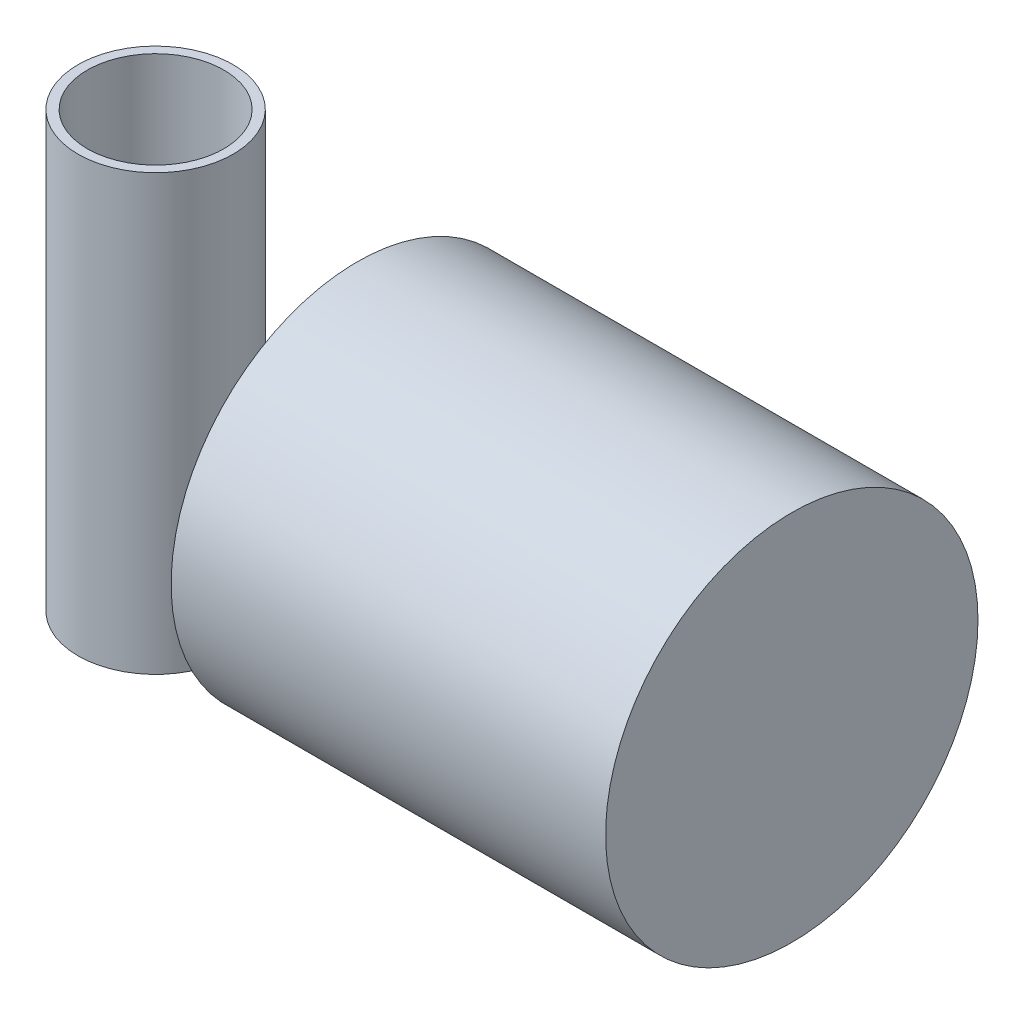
ISO-10303-21;
HEADER;
FILE_DESCRIPTION(('STEP AP214'),'2;1');
FILE_NAME('part.step','',(''),(''),'','','');
FILE_SCHEMA(('AUTOMOTIVE_DESIGN { 1 0 10303 214 1 1 1 1 }'));
ENDSEC;
DATA;
#1=APPLICATION_CONTEXT('core data for automotive mechanical design processes');
#2=APPLICATION_PROTOCOL_DEFINITION('international standard','automotive_design',2000,#1);
#3=PRODUCT_CONTEXT('',#1,'mechanical');
#4=PRODUCT('Part','Part','',(#3));
#5=PRODUCT_RELATED_PRODUCT_CATEGORY('part','',(#4));
#6=PRODUCT_DEFINITION_FORMATION('','',#4);
#7=PRODUCT_DEFINITION_CONTEXT('part definition',#1,'design');
#8=PRODUCT_DEFINITION('design','',#6,#7);
#9=PRODUCT_DEFINITION_SHAPE('','',#8);
#10=(LENGTH_UNIT() NAMED_UNIT(*) SI_UNIT(.MILLI.,.METRE.));
#11=(NAMED_UNIT(*) PLANE_ANGLE_UNIT() SI_UNIT($,.RADIAN.));
#12=(NAMED_UNIT(*) SI_UNIT($,.STERADIAN.) SOLID_ANGLE_UNIT());
#13=UNCERTAINTY_MEASURE_WITH_UNIT(LENGTH_MEASURE(1.E-05),#10,'distance_accuracy_value','');
#14=(GEOMETRIC_REPRESENTATION_CONTEXT(3) GLOBAL_UNCERTAINTY_ASSIGNED_CONTEXT((#13)) GLOBAL_UNIT_ASSIGNED_CONTEXT((#10,
#11,#12)) REPRESENTATION_CONTEXT('',''));
#15=CARTESIAN_POINT('',(0.,0.,0.));
#16=DIRECTION('',(0.,0.,1.));
#17=DIRECTION('',(1.,0.,0.));
#18=AXIS2_PLACEMENT_3D('',#15,#16,#17);
#19=CARTESIAN_POINT('',(-32.5,35.,0.));
#20=DIRECTION('',(0.,1.,0.));
#21=DIRECTION('',(0.,0.,1.));
#22=AXIS2_PLACEMENT_3D('',#19,#20,#21);
#23=CYLINDRICAL_SURFACE('',#22,12.5);
#24=CARTESIAN_POINT('',(-32.5,35.,0.));
#25=DIRECTION('',(0.,1.,0.));
#26=DIRECTION('',(0.,0.,1.));
#27=AXIS2_PLACEMENT_3D('',#24,#25,#26);
#28=CIRCLE('',#27,12.5);
#29=CARTESIAN_POINT('',(-32.5,35.,12.5));
#30=VERTEX_POINT('',#29);
#31=EDGE_CURVE('P0_E28',#30,#30,#28,.T.);
#32=ORIENTED_EDGE('',*,*,#31,.F.);
#33=EDGE_LOOP('',(#32));
#34=FACE_BOUND('',#33,.T.);
#35=CARTESIAN_POINT('',(-32.5,-35.,0.));
#36=DIRECTION('',(0.,1.,0.));
#37=DIRECTION('',(0.,0.,1.));
#38=AXIS2_PLACEMENT_3D('',#35,#36,#37);
#39=CIRCLE('',#38,12.5);
#40=CARTESIAN_POINT('',(-32.5,-35.,12.5));
#41=VERTEX_POINT('',#40);
#42=EDGE_CURVE('P0_E19',#41,#41,#39,.F.);
#43=ORIENTED_EDGE('',*,*,#42,.F.);
#44=EDGE_LOOP('',(#43));
#45=FACE_BOUND('',#44,.T.);
#46=ADVANCED_FACE('P0_F15',(#34,#45),#23,.T.);
#47=CARTESIAN_POINT('',(-46.25,-35.,13.75));
#48=DIRECTION('',(0.,-1.,0.));
#49=DIRECTION('',(0.,0.,-1.));
#50=AXIS2_PLACEMENT_3D('',#47,#48,#49);
#51=PLANE('',#50);
#52=CARTESIAN_POINT('',(-32.5,-35.,0.));
#53=DIRECTION('',(0.,1.,0.));
#54=DIRECTION('',(0.,0.,1.));
#55=AXIS2_PLACEMENT_3D('',#52,#53,#54);
#56=CIRCLE('',#55,11.);
#57=CARTESIAN_POINT('',(-32.5,-35.,11.));
#58=VERTEX_POINT('',#57);
#59=EDGE_CURVE('P0_E23',#58,#58,#56,.F.);
#60=ORIENTED_EDGE('',*,*,#59,.F.);
#61=EDGE_LOOP('',(#60));
#62=FACE_BOUND('',#61,.T.);
#63=ORIENTED_EDGE('',*,*,#42,.T.);
#64=EDGE_LOOP('',(#63));
#65=FACE_BOUND('',#64,.T.);
#66=ADVANCED_FACE('P0_F36',(#62,#65),#51,.T.);
#67=CARTESIAN_POINT('',(-46.25,35.,-13.75));
#68=DIRECTION('',(0.,1.,0.));
#69=DIRECTION('',(0.,0.,1.));
#70=AXIS2_PLACEMENT_3D('',#67,#68,#69);
#71=PLANE('',#70);
#72=CARTESIAN_POINT('',(-32.5,35.,0.));
#73=DIRECTION('',(0.,1.,0.));
#74=DIRECTION('',(0.,0.,1.));
#75=AXIS2_PLACEMENT_3D('',#72,#73,#74);
#76=CIRCLE('',#75,11.);
#77=CARTESIAN_POINT('',(-32.5,35.,11.));
#78=VERTEX_POINT('',#77);
#79=EDGE_CURVE('P0_E10',#78,#78,#76,.T.);
#80=ORIENTED_EDGE('',*,*,#79,.F.);
#81=EDGE_LOOP('',(#80));
#82=FACE_BOUND('',#81,.T.);
#83=ORIENTED_EDGE('',*,*,#31,.T.);
#84=EDGE_LOOP('',(#83));
#85=FACE_BOUND('',#84,.T.);
#86=ADVANCED_FACE('P0_F45',(#82,#85),#71,.T.);
#87=CARTESIAN_POINT('',(-32.5,-35.,0.));
#88=DIRECTION('',(0.,1.,0.));
#89=DIRECTION('',(0.,0.,1.));
#90=AXIS2_PLACEMENT_3D('',#87,#88,#89);
#91=CYLINDRICAL_SURFACE('',#90,11.);
#92=ORIENTED_EDGE('',*,*,#79,.T.);
#93=EDGE_LOOP('',(#92));
#94=FACE_BOUND('',#93,.T.);
#95=ORIENTED_EDGE('',*,*,#59,.T.);
#96=EDGE_LOOP('',(#95));
#97=FACE_BOUND('',#96,.T.);
#98=ADVANCED_FACE('P0_F17',(#94,#97),#91,.F.);
#99=CLOSED_SHELL('',(#46,#66,#86,#98));
#100=MANIFOLD_SOLID_BREP('P0_B1',#99);
#101=CARTESIAN_POINT('',(70.,-33.,33.));
#102=DIRECTION('',(1.,0.,0.));
#103=DIRECTION('',(0.,0.,-1.));
#104=AXIS2_PLACEMENT_3D('',#101,#102,#103);
#105=PLANE('',#104);
#106=CARTESIAN_POINT('',(70.,0.,0.));
#107=DIRECTION('',(1.,0.,0.));
#108=DIRECTION('',(0.,0.,-1.));
#109=AXIS2_PLACEMENT_3D('',#106,#107,#108);
#110=CIRCLE('',#109,30.);
#111=CARTESIAN_POINT('',(70.,0.,-30.));
#112=VERTEX_POINT('',#111);
#113=EDGE_CURVE('P1_E19',#112,#112,#110,.F.);
#114=ORIENTED_EDGE('',*,*,#113,.F.);
#115=EDGE_LOOP('',(#114));
#116=FACE_BOUND('',#115,.T.);
#117=ADVANCED_FACE('P1_F15',(#116),#105,.T.);
#118=CARTESIAN_POINT('',(70.,0.,0.));
#119=DIRECTION('',(1.,0.,0.));
#120=DIRECTION('',(0.,0.,-1.));
#121=AXIS2_PLACEMENT_3D('',#118,#119,#120);
#122=CYLINDRICAL_SURFACE('',#121,30.);
#123=CARTESIAN_POINT('',(0.,0.,0.));
#124=DIRECTION('',(1.,0.,0.));
#125=DIRECTION('',(0.,0.,-1.));
#126=AXIS2_PLACEMENT_3D('',#123,#124,#125);
#127=CIRCLE('',#126,30.);
#128=CARTESIAN_POINT('',(0.,0.,-30.));
#129=VERTEX_POINT('',#128);
#130=EDGE_CURVE('P1_E28',#129,#129,#127,.F.);
#131=ORIENTED_EDGE('',*,*,#130,.F.);
#132=EDGE_LOOP('',(#131));
#133=FACE_BOUND('',#132,.T.);
#134=ORIENTED_EDGE('',*,*,#113,.T.);
#135=EDGE_LOOP('',(#134));
#136=FACE_BOUND('',#135,.T.);
#137=ADVANCED_FACE('P1_F36',(#133,#136),#122,.T.);
#138=CARTESIAN_POINT('',(0.,-33.,-33.));
#139=DIRECTION('',(-1.,0.,0.));
#140=DIRECTION('',(0.,0.,1.));
#141=AXIS2_PLACEMENT_3D('',#138,#139,#140);
#142=PLANE('',#141);
#143=CARTESIAN_POINT('',(0.,0.,0.));
#144=DIRECTION('',(1.,0.,0.));
#145=DIRECTION('',(0.,0.,-1.));
#146=AXIS2_PLACEMENT_3D('',#143,#144,#145);
#147=CIRCLE('',#146,1.00000000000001);
#148=CARTESIAN_POINT('',(0.,0.,-1.00000000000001));
#149=VERTEX_POINT('',#148);
#150=EDGE_CURVE('P1_E23',#149,#149,#147,.F.);
#151=ORIENTED_EDGE('',*,*,#150,.F.);
#152=EDGE_LOOP('',(#151));
#153=FACE_BOUND('',#152,.T.);
#154=ORIENTED_EDGE('',*,*,#130,.T.);
#155=EDGE_LOOP('',(#154));
#156=FACE_BOUND('',#155,.T.);
#157=ADVANCED_FACE('P1_F44',(#153,#156),#142,.T.);
#158=CARTESIAN_POINT('',(0.,0.,0.));
#159=DIRECTION('',(1.,0.,0.));
#160=DIRECTION('',(0.,0.,-1.));
#161=AXIS2_PLACEMENT_3D('',#158,#159,#160);
#162=CYLINDRICAL_SURFACE('',#161,1.00000000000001);
#163=CARTESIAN_POINT('',(-20.,0.,0.));
#164=DIRECTION('',(1.,0.,0.));
#165=DIRECTION('',(0.,0.,-1.));
#166=AXIS2_PLACEMENT_3D('',#163,#164,#165);
#167=CIRCLE('',#166,1.00000000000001);
#168=CARTESIAN_POINT('',(-20.,0.,-1.00000000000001));
#169=VERTEX_POINT('',#168);
#170=EDGE_CURVE('P1_E10',#169,#169,#167,.F.);
#171=ORIENTED_EDGE('',*,*,#170,.F.);
#172=EDGE_LOOP('',(#171));
#173=FACE_BOUND('',#172,.T.);
#174=ORIENTED_EDGE('',*,*,#150,.T.);
#175=EDGE_LOOP('',(#174));
#176=FACE_BOUND('',#175,.T.);
#177=ADVANCED_FACE('P1_F48',(#173,#176),#162,.T.);
#178=CARTESIAN_POINT('',(-20.,-1.10000000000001,-0.0500000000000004));
#179=DIRECTION('',(-1.,0.,0.));
#180=DIRECTION('',(0.,0.,1.));
#181=AXIS2_PLACEMENT_3D('',#178,#179,#180);
#182=PLANE('',#181);
#183=ORIENTED_EDGE('',*,*,#170,.T.);
#184=EDGE_LOOP('',(#183));
#185=FACE_BOUND('',#184,.T.);
#186=ADVANCED_FACE('P1_F17',(#185),#182,.T.);
#187=CLOSED_SHELL('',(#117,#137,#157,#177,#186));
#188=MANIFOLD_SOLID_BREP('P1_B1',#187);
#189=ADVANCED_BREP_SHAPE_REPRESENTATION('',(#18,#100,#188),#14);
#190=SHAPE_DEFINITION_REPRESENTATION(#9,#189);
ENDSEC;
END-ISO-10303-21;
